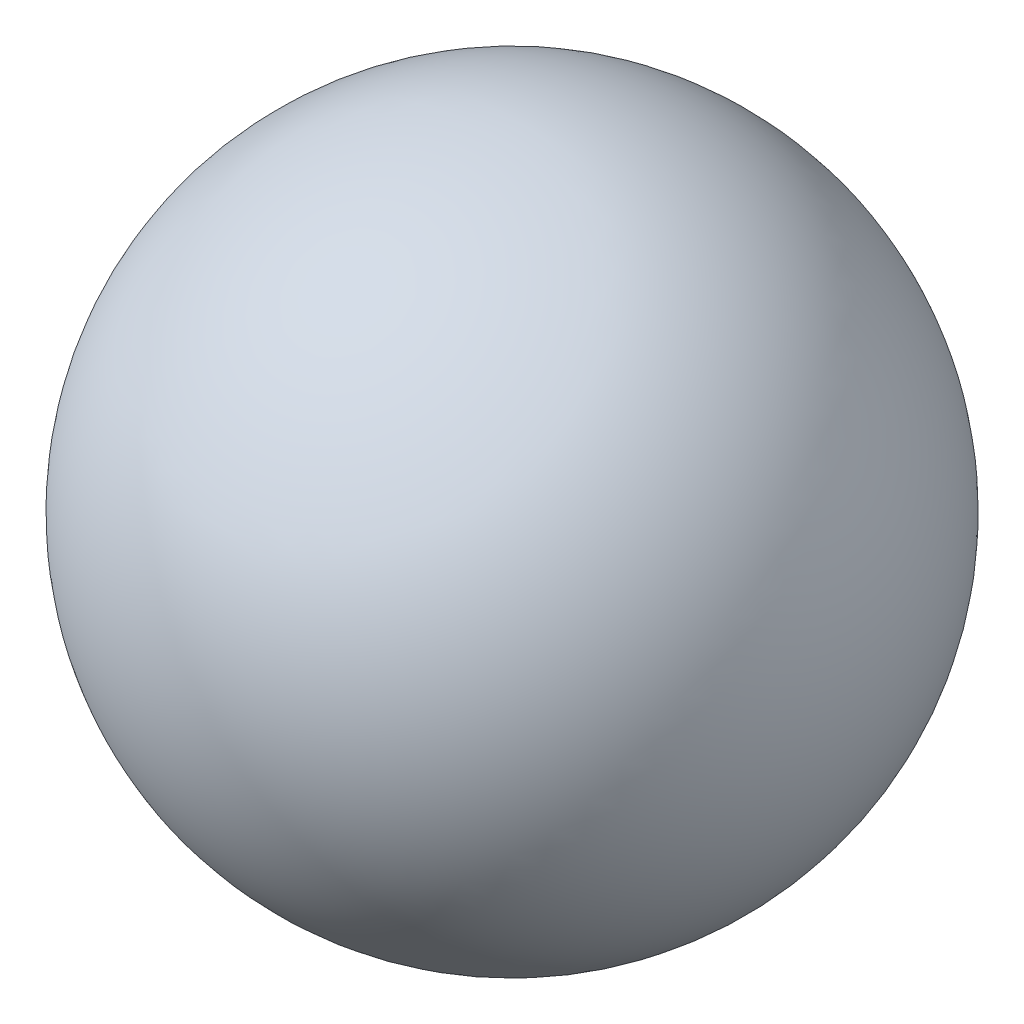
from build123d import *


with BuildPart() as part:
    # Sketch1 → Revolve1 (revolve)
    with BuildSketch(Plane(origin=(0, 0, 0), x_dir=(1, 0, 0), z_dir=(0, 1, 0))):
        with BuildLine():
            Line((0, 12.7), (0, 0))
            ThreePointArc((0, 0), (6.35, 6.35), (0, 12.7))
        make_face()
    revolve(axis=Axis((0, 0, 0), (0, 0, -1)))


solid = part.part
